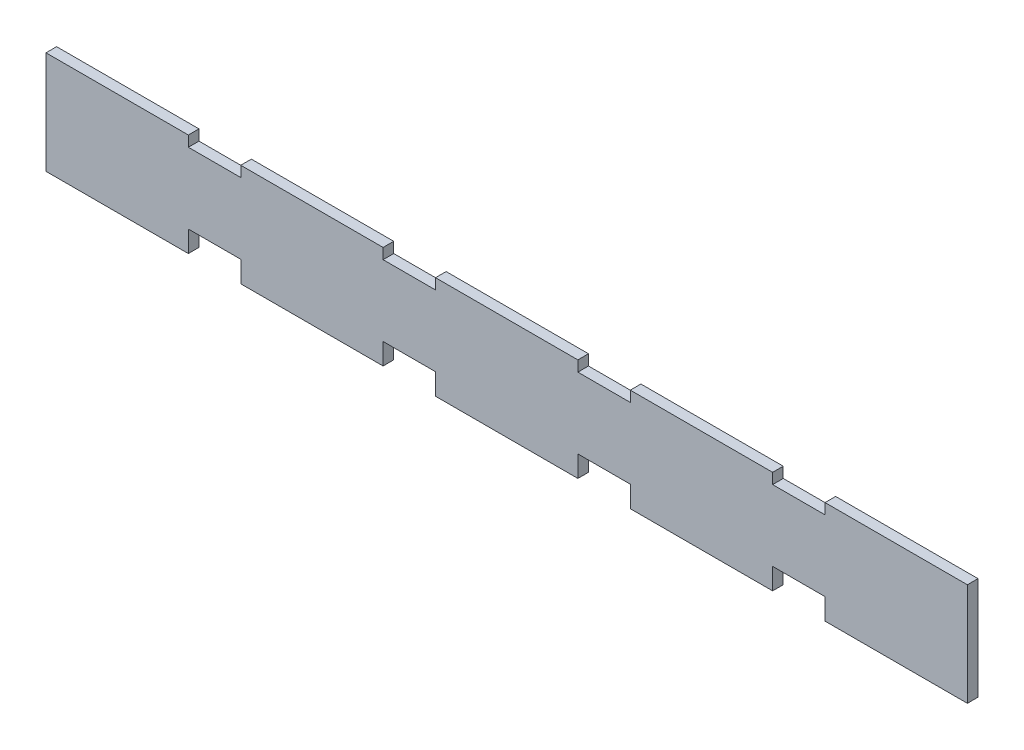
from build123d import *

# Parameters (mm, degrees)
BOSS_EXTRUDE1_DEPTH = 3


with BuildPart() as part:
    # Sketch1 → Boss-Extrude1 (new body)
    with BuildSketch(Plane.XY):
        Polygon((-75.1, -10), (-75.1, -16), (-34.9, -16), (-34.9, -10), (-20.1, -10), (-20.1, -16), (20.1, -16), (20.1, -10), (34.9, -10), (34.9, -16), (75.1, -16), (75.1, -10), (89.9, -10), (89.9, -16), (130.1, -16), (130.1, -10), (130.1, 10), (130.1, 13), (89.9, 13), (89.9, 10), (75.1, 10), (75.1, 13), (34.9, 13), (34.9, 10), (20.1, 10), (20.1, 13), (-20.1, 13), (-20.1, 10), (-34.9, 10), (-34.9, 13), (-75.1, 13), (-75.1, 10), (-89.9, 10), (-89.9, 13), (-130.1, 13), (-130.1, 10), (-130.1, -10), (-130.1, -16), (-89.9, -16), (-89.9, -10), align=None)
    extrude(amount=BOSS_EXTRUDE1_DEPTH)


solid = part.part
